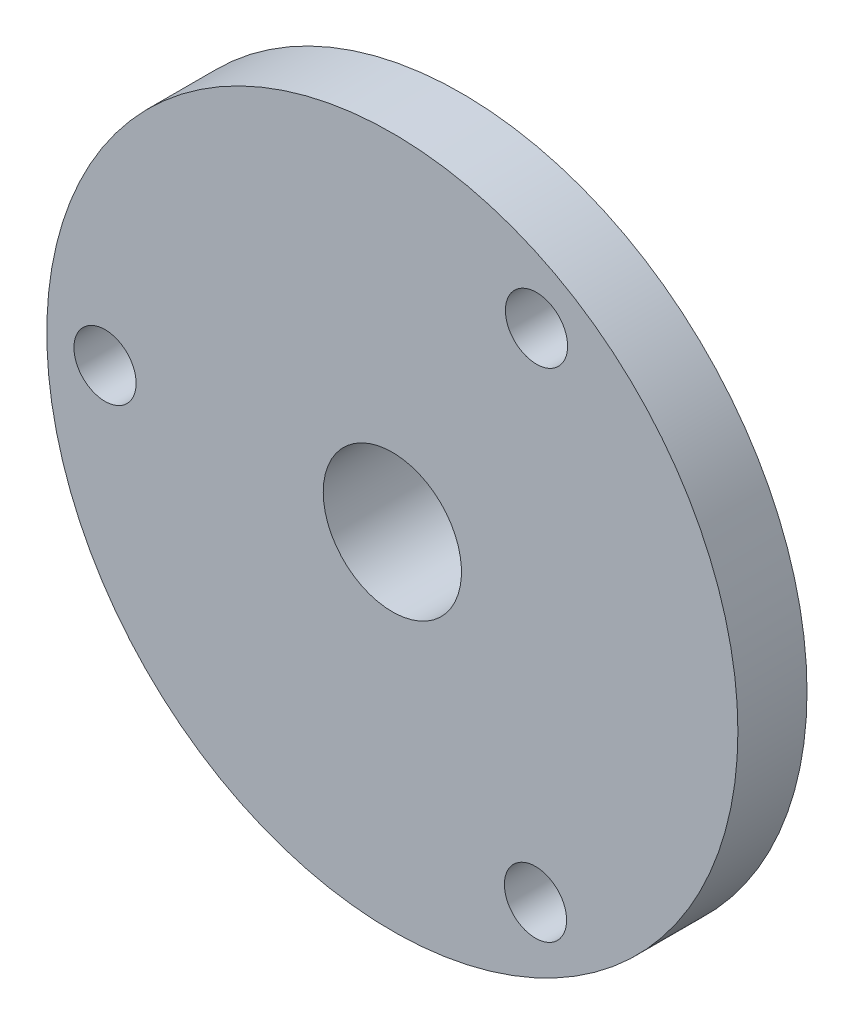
ISO-10303-21;
HEADER;
FILE_DESCRIPTION(('STEP AP214'),'2;1');
FILE_NAME('part.step','',(''),(''),'','','');
FILE_SCHEMA(('AUTOMOTIVE_DESIGN { 1 0 10303 214 1 1 1 1 }'));
ENDSEC;
DATA;
#1=APPLICATION_CONTEXT('core data for automotive mechanical design processes');
#2=APPLICATION_PROTOCOL_DEFINITION('international standard','automotive_design',2000,#1);
#3=PRODUCT_CONTEXT('',#1,'mechanical');
#4=PRODUCT('Part','Part','',(#3));
#5=PRODUCT_RELATED_PRODUCT_CATEGORY('part','',(#4));
#6=PRODUCT_DEFINITION_FORMATION('','',#4);
#7=PRODUCT_DEFINITION_CONTEXT('part definition',#1,'design');
#8=PRODUCT_DEFINITION('design','',#6,#7);
#9=PRODUCT_DEFINITION_SHAPE('','',#8);
#10=(LENGTH_UNIT() NAMED_UNIT(*) SI_UNIT(.MILLI.,.METRE.));
#11=(NAMED_UNIT(*) PLANE_ANGLE_UNIT() SI_UNIT($,.RADIAN.));
#12=(NAMED_UNIT(*) SI_UNIT($,.STERADIAN.) SOLID_ANGLE_UNIT());
#13=UNCERTAINTY_MEASURE_WITH_UNIT(LENGTH_MEASURE(1.E-05),#10,'distance_accuracy_value','');
#14=(GEOMETRIC_REPRESENTATION_CONTEXT(3) GLOBAL_UNCERTAINTY_ASSIGNED_CONTEXT((#13)) GLOBAL_UNIT_ASSIGNED_CONTEXT((#10,
#11,#12)) REPRESENTATION_CONTEXT('',''));
#15=CARTESIAN_POINT('',(0.,0.,0.));
#16=DIRECTION('',(0.,0.,1.));
#17=DIRECTION('',(1.,0.,0.));
#18=AXIS2_PLACEMENT_3D('',#15,#16,#17);
#19=CARTESIAN_POINT('',(0.,0.,10.));
#20=DIRECTION('',(0.,0.,-1.));
#21=DIRECTION('',(-1.,0.,0.));
#22=AXIS2_PLACEMENT_3D('',#19,#20,#21);
#23=CYLINDRICAL_SURFACE('',#22,50.);
#24=CARTESIAN_POINT('',(0.,0.,10.));
#25=DIRECTION('',(0.,0.,1.));
#26=DIRECTION('',(1.,0.,0.));
#27=AXIS2_PLACEMENT_3D('',#24,#25,#26);
#28=CIRCLE('',#27,50.);
#29=CARTESIAN_POINT('',(50.,0.,10.));
#30=VERTEX_POINT('',#29);
#31=EDGE_CURVE('E43',#30,#30,#28,.T.);
#32=ORIENTED_EDGE('',*,*,#31,.F.);
#33=EDGE_LOOP('',(#32));
#34=FACE_BOUND('',#33,.T.);
#35=CARTESIAN_POINT('',(0.,0.,0.));
#36=DIRECTION('',(0.,0.,1.));
#37=DIRECTION('',(1.,0.,0.));
#38=AXIS2_PLACEMENT_3D('',#35,#36,#37);
#39=CIRCLE('',#38,50.);
#40=CARTESIAN_POINT('',(50.,0.,0.));
#41=VERTEX_POINT('',#40);
#42=EDGE_CURVE('E50',#41,#41,#39,.T.);
#43=ORIENTED_EDGE('',*,*,#42,.T.);
#44=EDGE_LOOP('',(#43));
#45=FACE_BOUND('',#44,.T.);
#46=ADVANCED_FACE('F36',(#34,#45),#23,.T.);
#47=CARTESIAN_POINT('',(0.,0.,10.));
#48=DIRECTION('',(0.,0.,1.));
#49=DIRECTION('',(1.,0.,0.));
#50=AXIS2_PLACEMENT_3D('',#47,#48,#49);
#51=PLANE('',#50);
#52=CARTESIAN_POINT('',(0.,0.,10.));
#53=DIRECTION('',(0.,0.,-1.));
#54=DIRECTION('',(-1.,0.,0.));
#55=AXIS2_PLACEMENT_3D('',#52,#53,#54);
#56=CIRCLE('',#55,10.);
#57=CARTESIAN_POINT('',(-10.,0.,10.));
#58=VERTEX_POINT('',#57);
#59=EDGE_CURVE('E77',#58,#58,#56,.T.);
#60=ORIENTED_EDGE('',*,*,#59,.T.);
#61=EDGE_LOOP('',(#60));
#62=FACE_BOUND('',#61,.T.);
#63=CARTESIAN_POINT('',(20.8562281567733,35.9585559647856,10.));
#64=DIRECTION('',(0.,0.,-1.));
#65=DIRECTION('',(-1.,0.,0.));
#66=AXIS2_PLACEMENT_3D('',#63,#64,#65);
#67=CIRCLE('',#66,4.5);
#68=CARTESIAN_POINT('',(16.3562281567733,35.9585559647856,10.));
#69=VERTEX_POINT('',#68);
#70=EDGE_CURVE('E60',#69,#69,#67,.T.);
#71=ORIENTED_EDGE('',*,*,#70,.T.);
#72=EDGE_LOOP('',(#71));
#73=FACE_BOUND('',#72,.T.);
#74=CARTESIAN_POINT('',(20.7129088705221,-36.0413013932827,10.));
#75=DIRECTION('',(0.,0.,-1.));
#76=DIRECTION('',(-1.,0.,0.));
#77=AXIS2_PLACEMENT_3D('',#74,#75,#76);
#78=CIRCLE('',#77,4.5);
#79=CARTESIAN_POINT('',(16.2129088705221,-36.0413013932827,10.));
#80=VERTEX_POINT('',#79);
#81=EDGE_CURVE('E66',#80,#80,#78,.T.);
#82=ORIENTED_EDGE('',*,*,#81,.T.);
#83=EDGE_LOOP('',(#82));
#84=FACE_BOUND('',#83,.T.);
#85=CARTESIAN_POINT('',(-41.5691370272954,0.0827454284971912,10.));
#86=DIRECTION('',(0.,0.,-1.));
#87=DIRECTION('',(-1.,0.,0.));
#88=AXIS2_PLACEMENT_3D('',#85,#86,#87);
#89=CIRCLE('',#88,4.5);
#90=CARTESIAN_POINT('',(-46.0691370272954,0.0827454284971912,10.));
#91=VERTEX_POINT('',#90);
#92=EDGE_CURVE('E55',#91,#91,#89,.T.);
#93=ORIENTED_EDGE('',*,*,#92,.T.);
#94=EDGE_LOOP('',(#93));
#95=FACE_BOUND('',#94,.T.);
#96=ORIENTED_EDGE('',*,*,#31,.T.);
#97=EDGE_LOOP('',(#96));
#98=FACE_BOUND('',#97,.T.);
#99=ADVANCED_FACE('F84',(#62,#73,#84,#95,#98),#51,.T.);
#100=CARTESIAN_POINT('',(0.,0.,0.));
#101=DIRECTION('',(0.,0.,1.));
#102=DIRECTION('',(1.,0.,0.));
#103=AXIS2_PLACEMENT_3D('',#100,#101,#102);
#104=PLANE('',#103);
#105=CARTESIAN_POINT('',(0.,0.,0.));
#106=DIRECTION('',(0.,0.,1.));
#107=DIRECTION('',(1.,0.,0.));
#108=AXIS2_PLACEMENT_3D('',#105,#106,#107);
#109=CIRCLE('',#108,15.);
#110=CARTESIAN_POINT('',(15.,0.,0.));
#111=VERTEX_POINT('',#110);
#112=EDGE_CURVE('E10',#111,#111,#109,.F.);
#113=ORIENTED_EDGE('',*,*,#112,.F.);
#114=EDGE_LOOP('',(#113));
#115=FACE_BOUND('',#114,.T.);
#116=CARTESIAN_POINT('',(20.8562281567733,35.9585559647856,0.));
#117=DIRECTION('',(0.,0.,-1.));
#118=DIRECTION('',(-1.,0.,0.));
#119=AXIS2_PLACEMENT_3D('',#116,#117,#118);
#120=CIRCLE('',#119,4.5);
#121=CARTESIAN_POINT('',(16.3562281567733,35.9585559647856,0.));
#122=VERTEX_POINT('',#121);
#123=EDGE_CURVE('E70',#122,#122,#120,.T.);
#124=ORIENTED_EDGE('',*,*,#123,.F.);
#125=EDGE_LOOP('',(#124));
#126=FACE_BOUND('',#125,.T.);
#127=CARTESIAN_POINT('',(20.7129088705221,-36.0413013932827,0.));
#128=DIRECTION('',(0.,0.,-1.));
#129=DIRECTION('',(-1.,0.,0.));
#130=AXIS2_PLACEMENT_3D('',#127,#128,#129);
#131=CIRCLE('',#130,4.5);
#132=CARTESIAN_POINT('',(16.2129088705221,-36.0413013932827,0.));
#133=VERTEX_POINT('',#132);
#134=EDGE_CURVE('E63',#133,#133,#131,.T.);
#135=ORIENTED_EDGE('',*,*,#134,.F.);
#136=EDGE_LOOP('',(#135));
#137=FACE_BOUND('',#136,.T.);
#138=CARTESIAN_POINT('',(-41.5691370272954,0.0827454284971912,0.));
#139=DIRECTION('',(0.,0.,-1.));
#140=DIRECTION('',(-1.,0.,0.));
#141=AXIS2_PLACEMENT_3D('',#138,#139,#140);
#142=CIRCLE('',#141,4.5);
#143=CARTESIAN_POINT('',(-46.0691370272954,0.0827454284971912,0.));
#144=VERTEX_POINT('',#143);
#145=EDGE_CURVE('E57',#144,#144,#142,.T.);
#146=ORIENTED_EDGE('',*,*,#145,.F.);
#147=EDGE_LOOP('',(#146));
#148=FACE_BOUND('',#147,.T.);
#149=ORIENTED_EDGE('',*,*,#42,.F.);
#150=EDGE_LOOP('',(#149));
#151=FACE_BOUND('',#150,.T.);
#152=ADVANCED_FACE('F113',(#115,#126,#137,#148,#151),#104,.F.);
#153=CARTESIAN_POINT('',(-41.5691370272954,0.0827454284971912,10.));
#154=DIRECTION('',(0.,0.,-1.));
#155=DIRECTION('',(-1.,0.,0.));
#156=AXIS2_PLACEMENT_3D('',#153,#154,#155);
#157=CYLINDRICAL_SURFACE('',#156,4.5);
#158=ORIENTED_EDGE('',*,*,#92,.F.);
#159=EDGE_LOOP('',(#158));
#160=FACE_BOUND('',#159,.T.);
#161=ORIENTED_EDGE('',*,*,#145,.T.);
#162=EDGE_LOOP('',(#161));
#163=FACE_BOUND('',#162,.T.);
#164=ADVANCED_FACE('F119',(#160,#163),#157,.F.);
#165=CARTESIAN_POINT('',(20.7129088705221,-36.0413013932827,10.));
#166=DIRECTION('',(0.,0.,-1.));
#167=DIRECTION('',(-1.,0.,0.));
#168=AXIS2_PLACEMENT_3D('',#165,#166,#167);
#169=CYLINDRICAL_SURFACE('',#168,4.5);
#170=ORIENTED_EDGE('',*,*,#81,.F.);
#171=EDGE_LOOP('',(#170));
#172=FACE_BOUND('',#171,.T.);
#173=ORIENTED_EDGE('',*,*,#134,.T.);
#174=EDGE_LOOP('',(#173));
#175=FACE_BOUND('',#174,.T.);
#176=ADVANCED_FACE('F106',(#172,#175),#169,.F.);
#177=CARTESIAN_POINT('',(20.8562281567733,35.9585559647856,10.));
#178=DIRECTION('',(0.,0.,-1.));
#179=DIRECTION('',(-1.,0.,0.));
#180=AXIS2_PLACEMENT_3D('',#177,#178,#179);
#181=CYLINDRICAL_SURFACE('',#180,4.5);
#182=ORIENTED_EDGE('',*,*,#70,.F.);
#183=EDGE_LOOP('',(#182));
#184=FACE_BOUND('',#183,.T.);
#185=ORIENTED_EDGE('',*,*,#123,.T.);
#186=EDGE_LOOP('',(#185));
#187=FACE_BOUND('',#186,.T.);
#188=ADVANCED_FACE('F101',(#184,#187),#181,.F.);
#189=CARTESIAN_POINT('',(0.,0.,-10.));
#190=DIRECTION('',(0.,0.,1.));
#191=DIRECTION('',(1.,0.,0.));
#192=AXIS2_PLACEMENT_3D('',#189,#190,#191);
#193=CYLINDRICAL_SURFACE('',#192,15.);
#194=CARTESIAN_POINT('',(0.,0.,-10.));
#195=DIRECTION('',(0.,0.,-1.));
#196=DIRECTION('',(-1.,0.,0.));
#197=AXIS2_PLACEMENT_3D('',#194,#195,#196);
#198=CIRCLE('',#197,15.);
#199=CARTESIAN_POINT('',(-15.,0.,-10.));
#200=VERTEX_POINT('',#199);
#201=EDGE_CURVE('E67',#200,#200,#198,.T.);
#202=ORIENTED_EDGE('',*,*,#201,.F.);
#203=EDGE_LOOP('',(#202));
#204=FACE_BOUND('',#203,.T.);
#205=ORIENTED_EDGE('',*,*,#112,.T.);
#206=EDGE_LOOP('',(#205));
#207=FACE_BOUND('',#206,.T.);
#208=ADVANCED_FACE('F96',(#204,#207),#193,.T.);
#209=CARTESIAN_POINT('',(0.,0.,-10.));
#210=DIRECTION('',(0.,0.,-1.));
#211=DIRECTION('',(-1.,0.,0.));
#212=AXIS2_PLACEMENT_3D('',#209,#210,#211);
#213=PLANE('',#212);
#214=CARTESIAN_POINT('',(0.,0.,-10.));
#215=DIRECTION('',(0.,0.,-1.));
#216=DIRECTION('',(-1.,0.,0.));
#217=AXIS2_PLACEMENT_3D('',#214,#215,#216);
#218=CIRCLE('',#217,10.);
#219=CARTESIAN_POINT('',(-10.,0.,-10.));
#220=VERTEX_POINT('',#219);
#221=EDGE_CURVE('E78',#220,#220,#218,.T.);
#222=ORIENTED_EDGE('',*,*,#221,.F.);
#223=EDGE_LOOP('',(#222));
#224=FACE_BOUND('',#223,.T.);
#225=ORIENTED_EDGE('',*,*,#201,.T.);
#226=EDGE_LOOP('',(#225));
#227=FACE_BOUND('',#226,.T.);
#228=ADVANCED_FACE('F90',(#224,#227),#213,.T.);
#229=CARTESIAN_POINT('',(0.,0.,10.));
#230=DIRECTION('',(0.,0.,-1.));
#231=DIRECTION('',(-1.,0.,0.));
#232=AXIS2_PLACEMENT_3D('',#229,#230,#231);
#233=CYLINDRICAL_SURFACE('',#232,10.);
#234=ORIENTED_EDGE('',*,*,#59,.F.);
#235=EDGE_LOOP('',(#234));
#236=FACE_BOUND('',#235,.T.);
#237=ORIENTED_EDGE('',*,*,#221,.T.);
#238=EDGE_LOOP('',(#237));
#239=FACE_BOUND('',#238,.T.);
#240=ADVANCED_FACE('F87',(#236,#239),#233,.F.);
#241=CLOSED_SHELL('',(#46,#99,#152,#164,#176,#188,#208,#228,#240));
#242=MANIFOLD_SOLID_BREP('B2',#241);
#243=ADVANCED_BREP_SHAPE_REPRESENTATION('',(#18,#242),#14);
#244=SHAPE_DEFINITION_REPRESENTATION(#9,#243);
ENDSEC;
END-ISO-10303-21;
